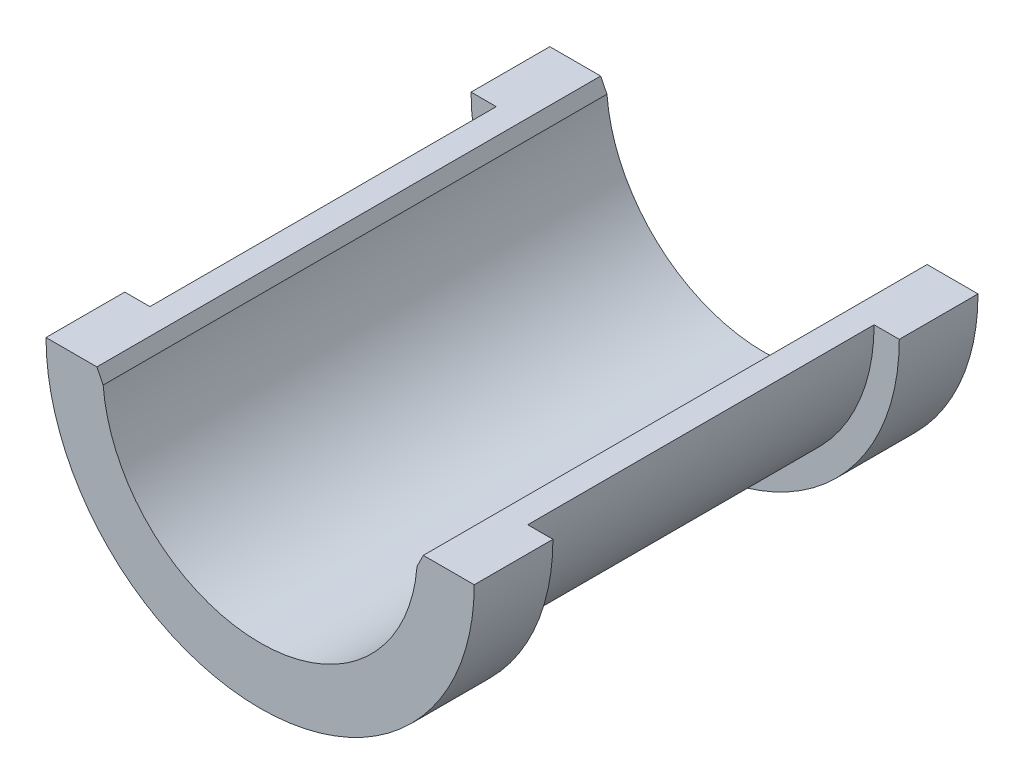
ISO-10303-21;
HEADER;
FILE_DESCRIPTION(('STEP AP214'),'2;1');
FILE_NAME('part.step','',(''),(''),'','','');
FILE_SCHEMA(('AUTOMOTIVE_DESIGN { 1 0 10303 214 1 1 1 1 }'));
ENDSEC;
DATA;
#1=APPLICATION_CONTEXT('core data for automotive mechanical design processes');
#2=APPLICATION_PROTOCOL_DEFINITION('international standard','automotive_design',2000,#1);
#3=PRODUCT_CONTEXT('',#1,'mechanical');
#4=PRODUCT('Part','Part','',(#3));
#5=PRODUCT_RELATED_PRODUCT_CATEGORY('part','',(#4));
#6=PRODUCT_DEFINITION_FORMATION('','',#4);
#7=PRODUCT_DEFINITION_CONTEXT('part definition',#1,'design');
#8=PRODUCT_DEFINITION('design','',#6,#7);
#9=PRODUCT_DEFINITION_SHAPE('','',#8);
#10=(LENGTH_UNIT() NAMED_UNIT(*) SI_UNIT(.MILLI.,.METRE.));
#11=(NAMED_UNIT(*) PLANE_ANGLE_UNIT() SI_UNIT($,.RADIAN.));
#12=(NAMED_UNIT(*) SI_UNIT($,.STERADIAN.) SOLID_ANGLE_UNIT());
#13=UNCERTAINTY_MEASURE_WITH_UNIT(LENGTH_MEASURE(1.E-05),#10,'distance_accuracy_value','');
#14=(GEOMETRIC_REPRESENTATION_CONTEXT(3) GLOBAL_UNCERTAINTY_ASSIGNED_CONTEXT((#13)) GLOBAL_UNIT_ASSIGNED_CONTEXT((#10,
#11,#12)) REPRESENTATION_CONTEXT('',''));
#15=CARTESIAN_POINT('',(0.,0.,0.));
#16=DIRECTION('',(0.,0.,1.));
#17=DIRECTION('',(1.,0.,0.));
#18=AXIS2_PLACEMENT_3D('',#15,#16,#17);
#19=CARTESIAN_POINT('',(0.,70.,40.));
#20=DIRECTION('',(0.,0.,-1.));
#21=DIRECTION('',(-1.,0.,0.));
#22=AXIS2_PLACEMENT_3D('',#19,#20,#21);
#23=CYLINDRICAL_SURFACE('',#22,25.);
#24=DIRECTION('',(0.,0.,1.));
#25=VECTOR('',#24,1.);
#26=CARTESIAN_POINT('',(24.9198715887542,68.,-40.));
#27=LINE('',#26,#25);
#28=CARTESIAN_POINT('',(24.9198715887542,68.,-40.));
#29=VERTEX_POINT('',#28);
#30=CARTESIAN_POINT('',(24.9198715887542,68.,40.));
#31=VERTEX_POINT('',#30);
#32=EDGE_CURVE('E107',#29,#31,#27,.T.);
#33=ORIENTED_EDGE('',*,*,#32,.F.);
#34=CARTESIAN_POINT('',(0.,70.,-40.));
#35=DIRECTION('',(0.,0.,-1.));
#36=DIRECTION('',(-1.,0.,0.));
#37=AXIS2_PLACEMENT_3D('',#34,#35,#36);
#38=CIRCLE('',#37,25.);
#39=CARTESIAN_POINT('',(-24.9198715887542,68.,-40.));
#40=VERTEX_POINT('',#39);
#41=EDGE_CURVE('E53',#29,#40,#38,.T.);
#42=ORIENTED_EDGE('',*,*,#41,.T.);
#43=DIRECTION('',(0.,0.,1.));
#44=VECTOR('',#43,1.);
#45=CARTESIAN_POINT('',(-24.9198715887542,68.,-40.));
#46=LINE('',#45,#44);
#47=CARTESIAN_POINT('',(-24.9198715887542,68.,40.));
#48=VERTEX_POINT('',#47);
#49=EDGE_CURVE('E175',#40,#48,#46,.T.);
#50=ORIENTED_EDGE('',*,*,#49,.T.);
#51=CARTESIAN_POINT('',(0.,70.,40.));
#52=DIRECTION('',(0.,0.,-1.));
#53=DIRECTION('',(-1.,0.,0.));
#54=AXIS2_PLACEMENT_3D('',#51,#52,#53);
#55=CIRCLE('',#54,25.);
#56=EDGE_CURVE('E114',#31,#48,#55,.T.);
#57=ORIENTED_EDGE('',*,*,#56,.F.);
#58=EDGE_LOOP('',(#33,#42,#50,#57));
#59=FACE_BOUND('',#58,.T.);
#60=ADVANCED_FACE('F31',(#59),#23,.F.);
#61=CARTESIAN_POINT('',(30.,70.,40.));
#62=DIRECTION('',(0.,-1.,0.));
#63=DIRECTION('',(0.,0.,-1.));
#64=AXIS2_PLACEMENT_3D('',#61,#62,#63);
#65=PLANE('',#64);
#66=DIRECTION('',(0.,0.,1.));
#67=VECTOR('',#66,1.);
#68=CARTESIAN_POINT('',(25.9198715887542,70.,-40.));
#69=LINE('',#68,#67);
#70=CARTESIAN_POINT('',(25.9198715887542,70.,-40.));
#71=VERTEX_POINT('',#70);
#72=CARTESIAN_POINT('',(25.9198715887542,70.,40.));
#73=VERTEX_POINT('',#72);
#74=EDGE_CURVE('E45',#71,#73,#69,.T.);
#75=ORIENTED_EDGE('',*,*,#74,.T.);
#76=DIRECTION('',(-1.,0.,0.));
#77=VECTOR('',#76,1.);
#78=CARTESIAN_POINT('',(30.,70.,40.));
#79=LINE('',#78,#77);
#80=CARTESIAN_POINT('',(34.,70.,40.));
#81=VERTEX_POINT('',#80);
#82=EDGE_CURVE('E129',#81,#73,#79,.T.);
#83=ORIENTED_EDGE('',*,*,#82,.F.);
#84=DIRECTION('',(0.,0.,1.));
#85=VECTOR('',#84,1.);
#86=CARTESIAN_POINT('',(34.,70.,-48.5263112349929));
#87=LINE('',#86,#85);
#88=CARTESIAN_POINT('',(34.,70.,27.5));
#89=VERTEX_POINT('',#88);
#90=EDGE_CURVE('E150',#89,#81,#87,.T.);
#91=ORIENTED_EDGE('',*,*,#90,.F.);
#92=DIRECTION('',(-1.,0.,0.));
#93=VECTOR('',#92,1.);
#94=CARTESIAN_POINT('',(34.,70.,27.5));
#95=LINE('',#94,#93);
#96=CARTESIAN_POINT('',(30.,70.,27.5));
#97=VERTEX_POINT('',#96);
#98=EDGE_CURVE('E126',#89,#97,#95,.T.);
#99=ORIENTED_EDGE('',*,*,#98,.T.);
#100=DIRECTION('',(0.,0.,-1.));
#101=VECTOR('',#100,1.);
#102=CARTESIAN_POINT('',(30.,70.,40.));
#103=LINE('',#102,#101);
#104=CARTESIAN_POINT('',(30.,70.,-27.5));
#105=VERTEX_POINT('',#104);
#106=EDGE_CURVE('E38',#97,#105,#103,.T.);
#107=ORIENTED_EDGE('',*,*,#106,.T.);
#108=DIRECTION('',(-1.,0.,0.));
#109=VECTOR('',#108,1.);
#110=CARTESIAN_POINT('',(25.,70.,-27.5));
#111=LINE('',#110,#109);
#112=CARTESIAN_POINT('',(34.,70.,-27.5));
#113=VERTEX_POINT('',#112);
#114=EDGE_CURVE('E162',#113,#105,#111,.T.);
#115=ORIENTED_EDGE('',*,*,#114,.F.);
#116=DIRECTION('',(0.,0.,-1.));
#117=VECTOR('',#116,1.);
#118=CARTESIAN_POINT('',(34.,70.,48.5263112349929));
#119=LINE('',#118,#117);
#120=CARTESIAN_POINT('',(34.,70.,-40.));
#121=VERTEX_POINT('',#120);
#122=EDGE_CURVE('E165',#113,#121,#119,.T.);
#123=ORIENTED_EDGE('',*,*,#122,.T.);
#124=DIRECTION('',(-1.,0.,0.));
#125=VECTOR('',#124,1.);
#126=CARTESIAN_POINT('',(30.,70.,-40.));
#127=LINE('',#126,#125);
#128=EDGE_CURVE('E123',#121,#71,#127,.T.);
#129=ORIENTED_EDGE('',*,*,#128,.T.);
#130=EDGE_LOOP('',(#75,#83,#91,#99,#107,#115,#123,#129));
#131=FACE_BOUND('',#130,.T.);
#132=ADVANCED_FACE('F187',(#131),#65,.F.);
#133=CARTESIAN_POINT('',(0.,70.,40.));
#134=DIRECTION('',(0.,0.,-1.));
#135=DIRECTION('',(-1.,0.,0.));
#136=AXIS2_PLACEMENT_3D('',#133,#134,#135);
#137=PLANE('',#136);
#138=DIRECTION('',(-0.447213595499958,-0.894427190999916,0.));
#139=VECTOR('',#138,1.);
#140=CARTESIAN_POINT('',(25.9198715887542,70.,40.));
#141=LINE('',#140,#139);
#142=EDGE_CURVE('E111',#73,#31,#141,.T.);
#143=ORIENTED_EDGE('',*,*,#142,.T.);
#144=ORIENTED_EDGE('',*,*,#56,.T.);
#145=DIRECTION('',(0.447213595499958,-0.894427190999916,0.));
#146=VECTOR('',#145,1.);
#147=CARTESIAN_POINT('',(-25.9198715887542,70.,40.));
#148=LINE('',#147,#146);
#149=CARTESIAN_POINT('',(-25.9198715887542,70.,40.));
#150=VERTEX_POINT('',#149);
#151=EDGE_CURVE('E181',#150,#48,#148,.T.);
#152=ORIENTED_EDGE('',*,*,#151,.F.);
#153=DIRECTION('',(-1.,0.,0.));
#154=VECTOR('',#153,1.);
#155=CARTESIAN_POINT('',(-25.,70.,40.));
#156=LINE('',#155,#154);
#157=CARTESIAN_POINT('',(-34.,70.,40.));
#158=VERTEX_POINT('',#157);
#159=EDGE_CURVE('E138',#150,#158,#156,.T.);
#160=ORIENTED_EDGE('',*,*,#159,.T.);
#161=CARTESIAN_POINT('',(0.,70.,40.));
#162=DIRECTION('',(0.,0.,1.));
#163=DIRECTION('',(1.,0.,0.));
#164=AXIS2_PLACEMENT_3D('',#161,#162,#163);
#165=CIRCLE('',#164,34.);
#166=EDGE_CURVE('E157',#158,#81,#165,.T.);
#167=ORIENTED_EDGE('',*,*,#166,.T.);
#168=ORIENTED_EDGE('',*,*,#82,.T.);
#169=EDGE_LOOP('',(#143,#144,#152,#160,#167,#168));
#170=FACE_BOUND('',#169,.T.);
#171=ADVANCED_FACE('F186',(#170),#137,.F.);
#172=CARTESIAN_POINT('',(0.,70.,-40.));
#173=DIRECTION('',(0.,0.,-1.));
#174=DIRECTION('',(-1.,0.,0.));
#175=AXIS2_PLACEMENT_3D('',#172,#173,#174);
#176=PLANE('',#175);
#177=ORIENTED_EDGE('',*,*,#41,.F.);
#178=DIRECTION('',(-0.447213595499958,-0.894427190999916,0.));
#179=VECTOR('',#178,1.);
#180=CARTESIAN_POINT('',(25.9198715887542,70.,-40.));
#181=LINE('',#180,#179);
#182=EDGE_CURVE('E105',#71,#29,#181,.T.);
#183=ORIENTED_EDGE('',*,*,#182,.F.);
#184=ORIENTED_EDGE('',*,*,#128,.F.);
#185=CARTESIAN_POINT('',(0.,70.,-40.));
#186=DIRECTION('',(0.,0.,-1.));
#187=DIRECTION('',(-1.,0.,0.));
#188=AXIS2_PLACEMENT_3D('',#185,#186,#187);
#189=CIRCLE('',#188,34.);
#190=CARTESIAN_POINT('',(-34.,70.,-40.));
#191=VERTEX_POINT('',#190);
#192=EDGE_CURVE('E169',#121,#191,#189,.T.);
#193=ORIENTED_EDGE('',*,*,#192,.T.);
#194=DIRECTION('',(-1.,0.,0.));
#195=VECTOR('',#194,1.);
#196=CARTESIAN_POINT('',(-25.,70.,-40.));
#197=LINE('',#196,#195);
#198=CARTESIAN_POINT('',(-25.9198715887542,70.,-40.));
#199=VERTEX_POINT('',#198);
#200=EDGE_CURVE('E120',#199,#191,#197,.T.);
#201=ORIENTED_EDGE('',*,*,#200,.F.);
#202=DIRECTION('',(0.447213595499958,-0.894427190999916,0.));
#203=VECTOR('',#202,1.);
#204=CARTESIAN_POINT('',(-25.9198715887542,70.,-40.));
#205=LINE('',#204,#203);
#206=EDGE_CURVE('E119',#199,#40,#205,.T.);
#207=ORIENTED_EDGE('',*,*,#206,.T.);
#208=EDGE_LOOP('',(#177,#183,#184,#193,#201,#207));
#209=FACE_BOUND('',#208,.T.);
#210=ADVANCED_FACE('F117',(#209),#176,.T.);
#211=CARTESIAN_POINT('',(0.,70.,40.));
#212=DIRECTION('',(0.,0.,-1.));
#213=DIRECTION('',(-1.,0.,0.));
#214=AXIS2_PLACEMENT_3D('',#211,#212,#213);
#215=CYLINDRICAL_SURFACE('',#214,30.);
#216=CARTESIAN_POINT('',(0.,70.,-27.5));
#217=DIRECTION('',(0.,0.,-1.));
#218=DIRECTION('',(-1.,0.,0.));
#219=AXIS2_PLACEMENT_3D('',#216,#217,#218);
#220=CIRCLE('',#219,30.);
#221=CARTESIAN_POINT('',(-30.,70.,-27.5));
#222=VERTEX_POINT('',#221);
#223=EDGE_CURVE('E159',#105,#222,#220,.T.);
#224=ORIENTED_EDGE('',*,*,#223,.F.);
#225=ORIENTED_EDGE('',*,*,#106,.F.);
#226=CARTESIAN_POINT('',(0.,70.,27.5));
#227=DIRECTION('',(0.,0.,-1.));
#228=DIRECTION('',(-1.,0.,0.));
#229=AXIS2_PLACEMENT_3D('',#226,#227,#228);
#230=CIRCLE('',#229,30.);
#231=CARTESIAN_POINT('',(-30.,70.,27.5));
#232=VERTEX_POINT('',#231);
#233=EDGE_CURVE('E121',#97,#232,#230,.T.);
#234=ORIENTED_EDGE('',*,*,#233,.T.);
#235=DIRECTION('',(0.,0.,-1.));
#236=VECTOR('',#235,1.);
#237=CARTESIAN_POINT('',(-30.,70.,40.));
#238=LINE('',#237,#236);
#239=EDGE_CURVE('E11',#232,#222,#238,.T.);
#240=ORIENTED_EDGE('',*,*,#239,.T.);
#241=EDGE_LOOP('',(#224,#225,#234,#240));
#242=FACE_BOUND('',#241,.T.);
#243=ADVANCED_FACE('F223',(#242),#215,.T.);
#244=CARTESIAN_POINT('',(-25.,70.,40.));
#245=DIRECTION('',(0.,-1.,0.));
#246=DIRECTION('',(0.,0.,-1.));
#247=AXIS2_PLACEMENT_3D('',#244,#245,#246);
#248=PLANE('',#247);
#249=ORIENTED_EDGE('',*,*,#159,.F.);
#250=DIRECTION('',(0.,0.,1.));
#251=VECTOR('',#250,1.);
#252=CARTESIAN_POINT('',(-25.9198715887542,70.,-40.));
#253=LINE('',#252,#251);
#254=EDGE_CURVE('E178',#199,#150,#253,.T.);
#255=ORIENTED_EDGE('',*,*,#254,.F.);
#256=ORIENTED_EDGE('',*,*,#200,.T.);
#257=DIRECTION('',(0.,0.,-1.));
#258=VECTOR('',#257,1.);
#259=CARTESIAN_POINT('',(-34.,70.,48.5263112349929));
#260=LINE('',#259,#258);
#261=CARTESIAN_POINT('',(-34.,70.,-27.5));
#262=VERTEX_POINT('',#261);
#263=EDGE_CURVE('E168',#262,#191,#260,.T.);
#264=ORIENTED_EDGE('',*,*,#263,.F.);
#265=DIRECTION('',(-1.,0.,0.));
#266=VECTOR('',#265,1.);
#267=CARTESIAN_POINT('',(-34.,70.,-27.5));
#268=LINE('',#267,#266);
#269=EDGE_CURVE('E164',#222,#262,#268,.T.);
#270=ORIENTED_EDGE('',*,*,#269,.F.);
#271=ORIENTED_EDGE('',*,*,#239,.F.);
#272=DIRECTION('',(-1.,0.,0.));
#273=VECTOR('',#272,1.);
#274=CARTESIAN_POINT('',(-25.,70.,27.5));
#275=LINE('',#274,#273);
#276=CARTESIAN_POINT('',(-34.,70.,27.5));
#277=VERTEX_POINT('',#276);
#278=EDGE_CURVE('E149',#232,#277,#275,.T.);
#279=ORIENTED_EDGE('',*,*,#278,.T.);
#280=DIRECTION('',(0.,0.,1.));
#281=VECTOR('',#280,1.);
#282=CARTESIAN_POINT('',(-34.,70.,-48.5263112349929));
#283=LINE('',#282,#281);
#284=EDGE_CURVE('E146',#277,#158,#283,.T.);
#285=ORIENTED_EDGE('',*,*,#284,.T.);
#286=EDGE_LOOP('',(#249,#255,#256,#264,#270,#271,#279,#285));
#287=FACE_BOUND('',#286,.T.);
#288=ADVANCED_FACE('F197',(#287),#248,.F.);
#289=CARTESIAN_POINT('',(0.,70.,27.5));
#290=DIRECTION('',(0.,0.,-1.));
#291=DIRECTION('',(-1.,0.,0.));
#292=AXIS2_PLACEMENT_3D('',#289,#290,#291);
#293=PLANE('',#292);
#294=ORIENTED_EDGE('',*,*,#233,.F.);
#295=ORIENTED_EDGE('',*,*,#98,.F.);
#296=CARTESIAN_POINT('',(0.,70.,27.5));
#297=DIRECTION('',(0.,0.,-1.));
#298=DIRECTION('',(-1.,0.,0.));
#299=AXIS2_PLACEMENT_3D('',#296,#297,#298);
#300=CIRCLE('',#299,34.);
#301=EDGE_CURVE('E148',#277,#89,#300,.F.);
#302=ORIENTED_EDGE('',*,*,#301,.F.);
#303=ORIENTED_EDGE('',*,*,#278,.F.);
#304=EDGE_LOOP('',(#294,#295,#302,#303));
#305=FACE_BOUND('',#304,.T.);
#306=ADVANCED_FACE('F227',(#305),#293,.T.);
#307=CARTESIAN_POINT('',(0.,70.,-48.5263112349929));
#308=DIRECTION('',(0.,0.,1.));
#309=DIRECTION('',(1.,0.,0.));
#310=AXIS2_PLACEMENT_3D('',#307,#308,#309);
#311=CYLINDRICAL_SURFACE('',#310,34.);
#312=ORIENTED_EDGE('',*,*,#284,.F.);
#313=ORIENTED_EDGE('',*,*,#301,.T.);
#314=ORIENTED_EDGE('',*,*,#90,.T.);
#315=ORIENTED_EDGE('',*,*,#166,.F.);
#316=EDGE_LOOP('',(#312,#313,#314,#315));
#317=FACE_BOUND('',#316,.T.);
#318=ADVANCED_FACE('F231',(#317),#311,.T.);
#319=CARTESIAN_POINT('',(0.,70.,-27.5));
#320=DIRECTION('',(0.,0.,-1.));
#321=DIRECTION('',(-1.,0.,0.));
#322=AXIS2_PLACEMENT_3D('',#319,#320,#321);
#323=PLANE('',#322);
#324=ORIENTED_EDGE('',*,*,#114,.T.);
#325=ORIENTED_EDGE('',*,*,#223,.T.);
#326=ORIENTED_EDGE('',*,*,#269,.T.);
#327=CARTESIAN_POINT('',(0.,70.,-27.5));
#328=DIRECTION('',(0.,0.,-1.));
#329=DIRECTION('',(-1.,0.,0.));
#330=AXIS2_PLACEMENT_3D('',#327,#328,#329);
#331=CIRCLE('',#330,34.);
#332=EDGE_CURVE('E172',#262,#113,#331,.F.);
#333=ORIENTED_EDGE('',*,*,#332,.T.);
#334=EDGE_LOOP('',(#324,#325,#326,#333));
#335=FACE_BOUND('',#334,.T.);
#336=ADVANCED_FACE('F209',(#335),#323,.F.);
#337=CARTESIAN_POINT('',(0.,70.,48.5263112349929));
#338=DIRECTION('',(0.,0.,-1.));
#339=DIRECTION('',(-1.,0.,0.));
#340=AXIS2_PLACEMENT_3D('',#337,#338,#339);
#341=CYLINDRICAL_SURFACE('',#340,34.);
#342=ORIENTED_EDGE('',*,*,#332,.F.);
#343=ORIENTED_EDGE('',*,*,#263,.T.);
#344=ORIENTED_EDGE('',*,*,#192,.F.);
#345=ORIENTED_EDGE('',*,*,#122,.F.);
#346=EDGE_LOOP('',(#342,#343,#344,#345));
#347=FACE_BOUND('',#346,.T.);
#348=ADVANCED_FACE('F193',(#347),#341,.T.);
#349=CARTESIAN_POINT('',(-25.9198715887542,70.,-40.));
#350=DIRECTION('',(-0.894427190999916,-0.447213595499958,0.));
#351=DIRECTION('',(0.447213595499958,-0.894427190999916,0.));
#352=AXIS2_PLACEMENT_3D('',#349,#350,#351);
#353=PLANE('',#352);
#354=ORIENTED_EDGE('',*,*,#151,.T.);
#355=ORIENTED_EDGE('',*,*,#49,.F.);
#356=ORIENTED_EDGE('',*,*,#206,.F.);
#357=ORIENTED_EDGE('',*,*,#254,.T.);
#358=EDGE_LOOP('',(#354,#355,#356,#357));
#359=FACE_BOUND('',#358,.T.);
#360=ADVANCED_FACE('F201',(#359),#353,.F.);
#361=CARTESIAN_POINT('',(25.9198715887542,70.,-40.));
#362=DIRECTION('',(-0.894427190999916,0.447213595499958,0.));
#363=DIRECTION('',(-0.447213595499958,-0.894427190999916,0.));
#364=AXIS2_PLACEMENT_3D('',#361,#362,#363);
#365=PLANE('',#364);
#366=ORIENTED_EDGE('',*,*,#142,.F.);
#367=ORIENTED_EDGE('',*,*,#74,.F.);
#368=ORIENTED_EDGE('',*,*,#182,.T.);
#369=ORIENTED_EDGE('',*,*,#32,.T.);
#370=EDGE_LOOP('',(#366,#367,#368,#369));
#371=FACE_BOUND('',#370,.T.);
#372=ADVANCED_FACE('F106',(#371),#365,.T.);
#373=CLOSED_SHELL('',(#60,#132,#171,#210,#243,#288,#306,#318,#336,#348,#360,#372));
#374=MANIFOLD_SOLID_BREP('B2',#373);
#375=ADVANCED_BREP_SHAPE_REPRESENTATION('',(#18,#374),#14);
#376=SHAPE_DEFINITION_REPRESENTATION(#9,#375);
ENDSEC;
END-ISO-10303-21;
